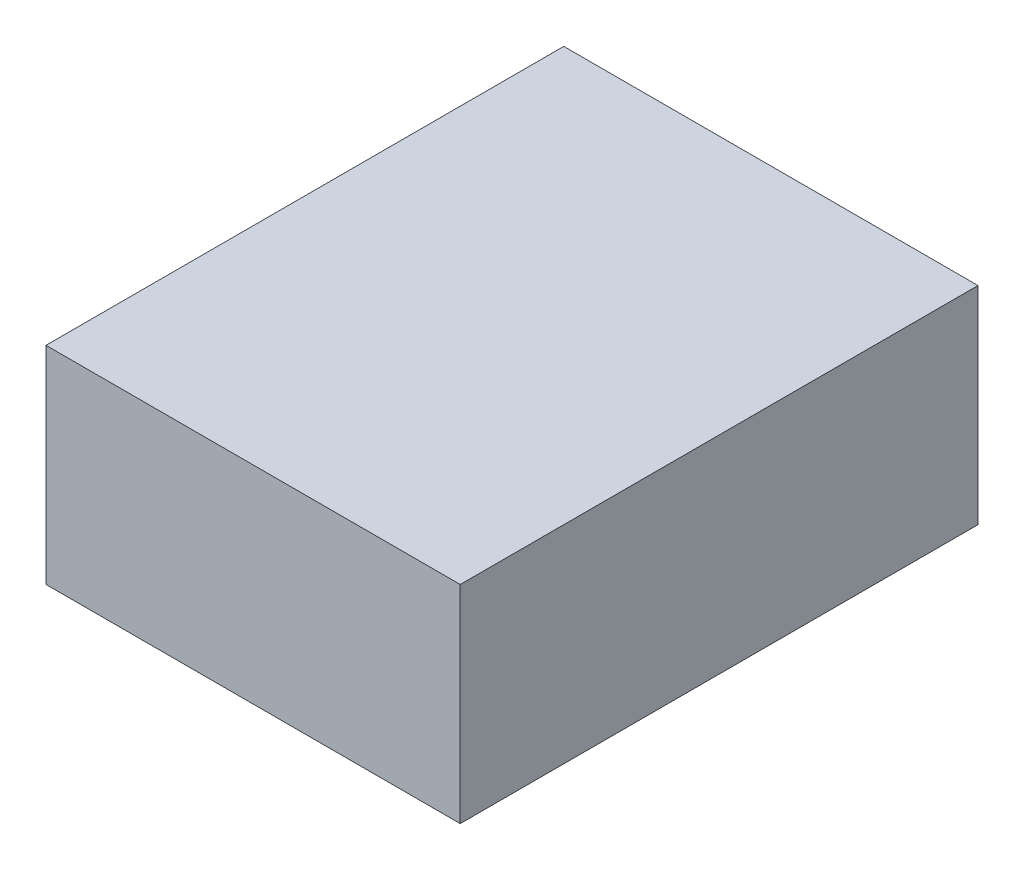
ISO-10303-21;
HEADER;
FILE_DESCRIPTION(('STEP AP214'),'2;1');
FILE_NAME('part.step','',(''),(''),'','','');
FILE_SCHEMA(('AUTOMOTIVE_DESIGN { 1 0 10303 214 1 1 1 1 }'));
ENDSEC;
DATA;
#1=APPLICATION_CONTEXT('core data for automotive mechanical design processes');
#2=APPLICATION_PROTOCOL_DEFINITION('international standard','automotive_design',2000,#1);
#3=PRODUCT_CONTEXT('',#1,'mechanical');
#4=PRODUCT('Part','Part','',(#3));
#5=PRODUCT_RELATED_PRODUCT_CATEGORY('part','',(#4));
#6=PRODUCT_DEFINITION_FORMATION('','',#4);
#7=PRODUCT_DEFINITION_CONTEXT('part definition',#1,'design');
#8=PRODUCT_DEFINITION('design','',#6,#7);
#9=PRODUCT_DEFINITION_SHAPE('','',#8);
#10=(LENGTH_UNIT() NAMED_UNIT(*) SI_UNIT(.MILLI.,.METRE.));
#11=(NAMED_UNIT(*) PLANE_ANGLE_UNIT() SI_UNIT($,.RADIAN.));
#12=(NAMED_UNIT(*) SI_UNIT($,.STERADIAN.) SOLID_ANGLE_UNIT());
#13=UNCERTAINTY_MEASURE_WITH_UNIT(LENGTH_MEASURE(1.E-05),#10,'distance_accuracy_value','');
#14=(GEOMETRIC_REPRESENTATION_CONTEXT(3) GLOBAL_UNCERTAINTY_ASSIGNED_CONTEXT((#13)) GLOBAL_UNIT_ASSIGNED_CONTEXT((#10,
#11,#12)) REPRESENTATION_CONTEXT('',''));
#15=CARTESIAN_POINT('',(0.,0.,0.));
#16=DIRECTION('',(0.,0.,1.));
#17=DIRECTION('',(1.,0.,0.));
#18=AXIS2_PLACEMENT_3D('',#15,#16,#17);
#19=CARTESIAN_POINT('',(-50.8,25.4,63.5));
#20=DIRECTION('',(1.,0.,0.));
#21=DIRECTION('',(0.,1.,0.));
#22=AXIS2_PLACEMENT_3D('',#19,#20,#21);
#23=PLANE('',#22);
#24=DIRECTION('',(0.,-1.,0.));
#25=VECTOR('',#24,1.);
#26=CARTESIAN_POINT('',(-50.8,25.4,-63.5));
#27=LINE('',#26,#25);
#28=CARTESIAN_POINT('',(-50.8,25.4,-63.5));
#29=VERTEX_POINT('',#28);
#30=CARTESIAN_POINT('',(-50.8,-25.4,-63.5));
#31=VERTEX_POINT('',#30);
#32=EDGE_CURVE('E93',#29,#31,#27,.T.);
#33=ORIENTED_EDGE('',*,*,#32,.T.);
#34=DIRECTION('',(0.,0.,-1.));
#35=VECTOR('',#34,1.);
#36=CARTESIAN_POINT('',(-50.8,-25.4,63.5));
#37=LINE('',#36,#35);
#38=CARTESIAN_POINT('',(-50.8,-25.4,63.5));
#39=VERTEX_POINT('',#38);
#40=EDGE_CURVE('E11',#39,#31,#37,.T.);
#41=ORIENTED_EDGE('',*,*,#40,.F.);
#42=DIRECTION('',(0.,-1.,0.));
#43=VECTOR('',#42,1.);
#44=CARTESIAN_POINT('',(-50.8,25.4,63.5));
#45=LINE('',#44,#43);
#46=CARTESIAN_POINT('',(-50.8,25.4,63.5));
#47=VERTEX_POINT('',#46);
#48=EDGE_CURVE('E81',#47,#39,#45,.T.);
#49=ORIENTED_EDGE('',*,*,#48,.F.);
#50=DIRECTION('',(0.,0.,-1.));
#51=VECTOR('',#50,1.);
#52=CARTESIAN_POINT('',(-50.8,25.4,63.5));
#53=LINE('',#52,#51);
#54=EDGE_CURVE('E89',#47,#29,#53,.T.);
#55=ORIENTED_EDGE('',*,*,#54,.T.);
#56=EDGE_LOOP('',(#33,#41,#49,#55));
#57=FACE_BOUND('',#56,.T.);
#58=ADVANCED_FACE('F30',(#57),#23,.F.);
#59=CARTESIAN_POINT('',(-50.8,-25.4,63.5));
#60=DIRECTION('',(0.,1.,0.));
#61=DIRECTION('',(-1.,0.,0.));
#62=AXIS2_PLACEMENT_3D('',#59,#60,#61);
#63=PLANE('',#62);
#64=DIRECTION('',(1.,0.,0.));
#65=VECTOR('',#64,1.);
#66=CARTESIAN_POINT('',(-50.8,-25.4,-63.5));
#67=LINE('',#66,#65);
#68=CARTESIAN_POINT('',(50.8,-25.4,-63.5));
#69=VERTEX_POINT('',#68);
#70=EDGE_CURVE('E85',#31,#69,#67,.T.);
#71=ORIENTED_EDGE('',*,*,#70,.T.);
#72=DIRECTION('',(0.,0.,-1.));
#73=VECTOR('',#72,1.);
#74=CARTESIAN_POINT('',(50.8,-25.4,63.5));
#75=LINE('',#74,#73);
#76=CARTESIAN_POINT('',(50.8,-25.4,63.5));
#77=VERTEX_POINT('',#76);
#78=EDGE_CURVE('E38',#77,#69,#75,.T.);
#79=ORIENTED_EDGE('',*,*,#78,.F.);
#80=DIRECTION('',(1.,0.,0.));
#81=VECTOR('',#80,1.);
#82=CARTESIAN_POINT('',(-50.8,-25.4,63.5));
#83=LINE('',#82,#81);
#84=EDGE_CURVE('E76',#39,#77,#83,.T.);
#85=ORIENTED_EDGE('',*,*,#84,.F.);
#86=ORIENTED_EDGE('',*,*,#40,.T.);
#87=EDGE_LOOP('',(#71,#79,#85,#86));
#88=FACE_BOUND('',#87,.T.);
#89=ADVANCED_FACE('F84',(#88),#63,.F.);
#90=CARTESIAN_POINT('',(50.8,25.4,63.5));
#91=DIRECTION('',(-1.,0.,0.));
#92=DIRECTION('',(0.,0.,1.));
#93=AXIS2_PLACEMENT_3D('',#90,#91,#92);
#94=PLANE('',#93);
#95=DIRECTION('',(0.,1.,0.));
#96=VECTOR('',#95,1.);
#97=CARTESIAN_POINT('',(50.8,25.4,-63.5));
#98=LINE('',#97,#96);
#99=CARTESIAN_POINT('',(50.8,25.4,-63.5));
#100=VERTEX_POINT('',#99);
#101=EDGE_CURVE('E63',#69,#100,#98,.T.);
#102=ORIENTED_EDGE('',*,*,#101,.T.);
#103=DIRECTION('',(0.,0.,-1.));
#104=VECTOR('',#103,1.);
#105=CARTESIAN_POINT('',(50.8,25.4,63.5));
#106=LINE('',#105,#104);
#107=CARTESIAN_POINT('',(50.8,25.4,63.5));
#108=VERTEX_POINT('',#107);
#109=EDGE_CURVE('E86',#108,#100,#106,.T.);
#110=ORIENTED_EDGE('',*,*,#109,.F.);
#111=DIRECTION('',(0.,1.,0.));
#112=VECTOR('',#111,1.);
#113=CARTESIAN_POINT('',(50.8,25.4,63.5));
#114=LINE('',#113,#112);
#115=EDGE_CURVE('E79',#77,#108,#114,.T.);
#116=ORIENTED_EDGE('',*,*,#115,.F.);
#117=ORIENTED_EDGE('',*,*,#78,.T.);
#118=EDGE_LOOP('',(#102,#110,#116,#117));
#119=FACE_BOUND('',#118,.T.);
#120=ADVANCED_FACE('F87',(#119),#94,.F.);
#121=CARTESIAN_POINT('',(-50.8,25.4,63.5));
#122=DIRECTION('',(0.,-1.,0.));
#123=DIRECTION('',(0.,0.,-1.));
#124=AXIS2_PLACEMENT_3D('',#121,#122,#123);
#125=PLANE('',#124);
#126=DIRECTION('',(-1.,0.,0.));
#127=VECTOR('',#126,1.);
#128=CARTESIAN_POINT('',(-50.8,25.4,-63.5));
#129=LINE('',#128,#127);
#130=EDGE_CURVE('E69',#100,#29,#129,.T.);
#131=ORIENTED_EDGE('',*,*,#130,.T.);
#132=ORIENTED_EDGE('',*,*,#54,.F.);
#133=DIRECTION('',(-1.,0.,0.));
#134=VECTOR('',#133,1.);
#135=CARTESIAN_POINT('',(-50.8,25.4,63.5));
#136=LINE('',#135,#134);
#137=EDGE_CURVE('E46',#108,#47,#136,.T.);
#138=ORIENTED_EDGE('',*,*,#137,.F.);
#139=ORIENTED_EDGE('',*,*,#109,.T.);
#140=EDGE_LOOP('',(#131,#132,#138,#139));
#141=FACE_BOUND('',#140,.T.);
#142=ADVANCED_FACE('F100',(#141),#125,.F.);
#143=CARTESIAN_POINT('',(-50.8,-25.4,63.5));
#144=DIRECTION('',(0.,0.,1.));
#145=DIRECTION('',(1.,0.,0.));
#146=AXIS2_PLACEMENT_3D('',#143,#144,#145);
#147=PLANE('',#146);
#148=ORIENTED_EDGE('',*,*,#48,.T.);
#149=ORIENTED_EDGE('',*,*,#84,.T.);
#150=ORIENTED_EDGE('',*,*,#115,.T.);
#151=ORIENTED_EDGE('',*,*,#137,.T.);
#152=EDGE_LOOP('',(#148,#149,#150,#151));
#153=FACE_BOUND('',#152,.T.);
#154=ADVANCED_FACE('F77',(#153),#147,.T.);
#155=CARTESIAN_POINT('',(-50.8,-25.4,-63.5));
#156=DIRECTION('',(0.,0.,1.));
#157=DIRECTION('',(1.,0.,0.));
#158=AXIS2_PLACEMENT_3D('',#155,#156,#157);
#159=PLANE('',#158);
#160=ORIENTED_EDGE('',*,*,#32,.F.);
#161=ORIENTED_EDGE('',*,*,#130,.F.);
#162=ORIENTED_EDGE('',*,*,#101,.F.);
#163=ORIENTED_EDGE('',*,*,#70,.F.);
#164=EDGE_LOOP('',(#160,#161,#162,#163));
#165=FACE_BOUND('',#164,.T.);
#166=ADVANCED_FACE('F103',(#165),#159,.F.);
#167=CLOSED_SHELL('',(#58,#89,#120,#142,#154,#166));
#168=MANIFOLD_SOLID_BREP('B2',#167);
#169=ADVANCED_BREP_SHAPE_REPRESENTATION('',(#18,#168),#14);
#170=SHAPE_DEFINITION_REPRESENTATION(#9,#169);
ENDSEC;
END-ISO-10303-21;
